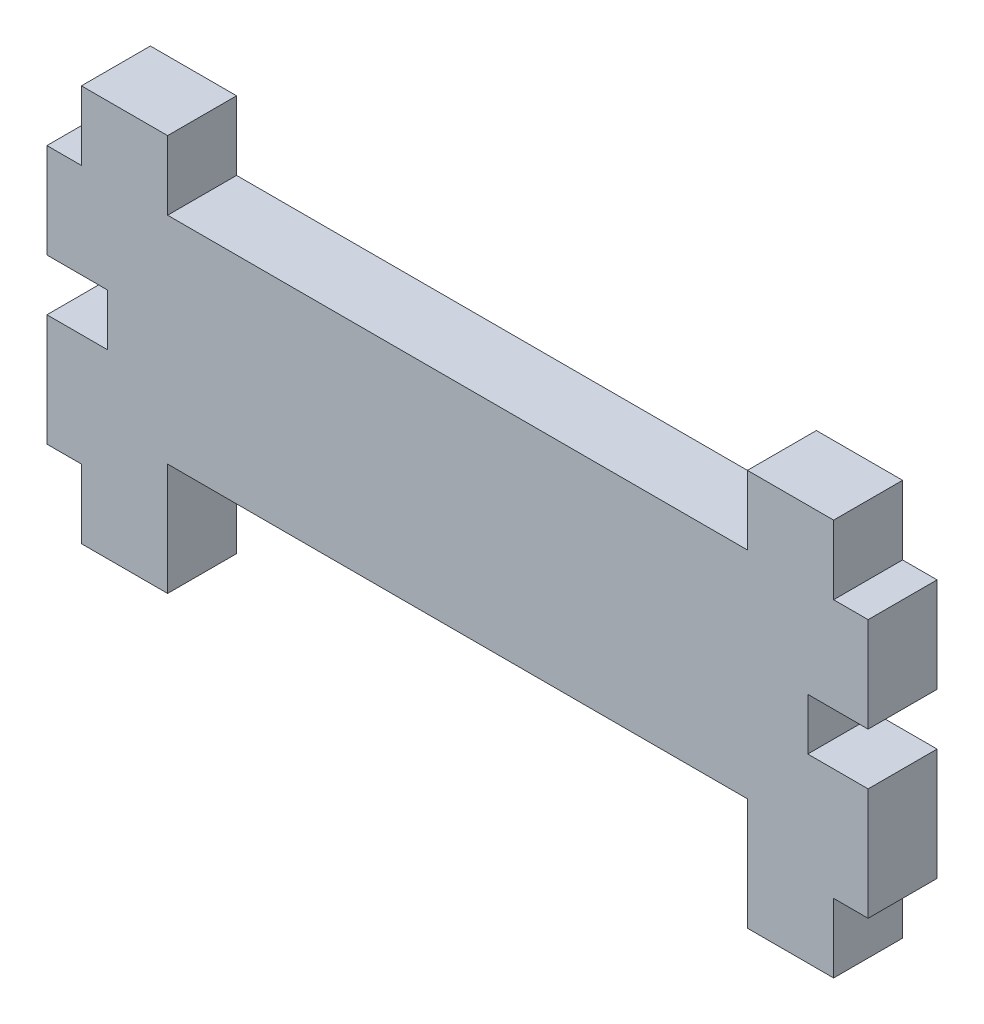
ISO-10303-21;
HEADER;
FILE_DESCRIPTION(('STEP AP214'),'2;1');
FILE_NAME('part.step','',(''),(''),'','','');
FILE_SCHEMA(('AUTOMOTIVE_DESIGN { 1 0 10303 214 1 1 1 1 }'));
ENDSEC;
DATA;
#1=APPLICATION_CONTEXT('core data for automotive mechanical design processes');
#2=APPLICATION_PROTOCOL_DEFINITION('international standard','automotive_design',2000,#1);
#3=PRODUCT_CONTEXT('',#1,'mechanical');
#4=PRODUCT('Part','Part','',(#3));
#5=PRODUCT_RELATED_PRODUCT_CATEGORY('part','',(#4));
#6=PRODUCT_DEFINITION_FORMATION('','',#4);
#7=PRODUCT_DEFINITION_CONTEXT('part definition',#1,'design');
#8=PRODUCT_DEFINITION('design','',#6,#7);
#9=PRODUCT_DEFINITION_SHAPE('','',#8);
#10=(LENGTH_UNIT() NAMED_UNIT(*) SI_UNIT(.MILLI.,.METRE.));
#11=(NAMED_UNIT(*) PLANE_ANGLE_UNIT() SI_UNIT($,.RADIAN.));
#12=(NAMED_UNIT(*) SI_UNIT($,.STERADIAN.) SOLID_ANGLE_UNIT());
#13=UNCERTAINTY_MEASURE_WITH_UNIT(LENGTH_MEASURE(1.E-05),#10,'distance_accuracy_value','');
#14=(GEOMETRIC_REPRESENTATION_CONTEXT(3) GLOBAL_UNCERTAINTY_ASSIGNED_CONTEXT((#13)) GLOBAL_UNIT_ASSIGNED_CONTEXT((#10,
#11,#12)) REPRESENTATION_CONTEXT('',''));
#15=CARTESIAN_POINT('',(0.,0.,0.));
#16=DIRECTION('',(0.,0.,1.));
#17=DIRECTION('',(1.,0.,0.));
#18=AXIS2_PLACEMENT_3D('',#15,#16,#17);
#19=CARTESIAN_POINT('',(35.0512616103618,-17.3140808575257,4.));
#20=DIRECTION('',(0.,1.,0.));
#21=DIRECTION('',(0.,0.,1.));
#22=AXIS2_PLACEMENT_3D('',#19,#20,#21);
#23=PLANE('',#22);
#24=DIRECTION('',(1.,0.,0.));
#25=VECTOR('',#24,1.);
#26=CARTESIAN_POINT('',(35.0512616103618,-17.3140808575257,0.));
#27=LINE('',#26,#25);
#28=CARTESIAN_POINT('',(33.0512616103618,-17.3140808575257,0.));
#29=VERTEX_POINT('',#28);
#30=CARTESIAN_POINT('',(35.0512616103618,-17.3140808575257,0.));
#31=VERTEX_POINT('',#30);
#32=EDGE_CURVE('E248',#29,#31,#27,.T.);
#33=ORIENTED_EDGE('',*,*,#32,.T.);
#34=DIRECTION('',(0.,0.,-1.));
#35=VECTOR('',#34,1.);
#36=CARTESIAN_POINT('',(35.0512616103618,-17.3140808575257,4.));
#37=LINE('',#36,#35);
#38=CARTESIAN_POINT('',(35.0512616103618,-17.3140808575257,4.));
#39=VERTEX_POINT('',#38);
#40=EDGE_CURVE('E11',#39,#31,#37,.T.);
#41=ORIENTED_EDGE('',*,*,#40,.F.);
#42=DIRECTION('',(1.,0.,0.));
#43=VECTOR('',#42,1.);
#44=CARTESIAN_POINT('',(35.0512616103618,-17.3140808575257,4.));
#45=LINE('',#44,#43);
#46=CARTESIAN_POINT('',(33.0512616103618,-17.3140808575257,4.));
#47=VERTEX_POINT('',#46);
#48=EDGE_CURVE('E304',#47,#39,#45,.T.);
#49=ORIENTED_EDGE('',*,*,#48,.F.);
#50=DIRECTION('',(0.,0.,-1.));
#51=VECTOR('',#50,1.);
#52=CARTESIAN_POINT('',(33.0512616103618,-17.3140808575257,4.));
#53=LINE('',#52,#51);
#54=EDGE_CURVE('E244',#47,#29,#53,.T.);
#55=ORIENTED_EDGE('',*,*,#54,.T.);
#56=EDGE_LOOP('',(#33,#41,#49,#55));
#57=FACE_BOUND('',#56,.T.);
#58=ADVANCED_FACE('F33',(#57),#23,.F.);
#59=CARTESIAN_POINT('',(35.0512616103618,-17.3140808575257,4.));
#60=DIRECTION('',(-1.,0.,0.));
#61=DIRECTION('',(0.,0.,1.));
#62=AXIS2_PLACEMENT_3D('',#59,#60,#61);
#63=PLANE('',#62);
#64=DIRECTION('',(0.,1.,0.));
#65=VECTOR('',#64,1.);
#66=CARTESIAN_POINT('',(35.0512616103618,-17.3140808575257,0.));
#67=LINE('',#66,#65);
#68=CARTESIAN_POINT('',(35.0512616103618,-10.8140808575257,0.));
#69=VERTEX_POINT('',#68);
#70=EDGE_CURVE('E251',#31,#69,#67,.T.);
#71=ORIENTED_EDGE('',*,*,#70,.T.);
#72=DIRECTION('',(0.,0.,-1.));
#73=VECTOR('',#72,1.);
#74=CARTESIAN_POINT('',(35.0512616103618,-10.8140808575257,4.));
#75=LINE('',#74,#73);
#76=CARTESIAN_POINT('',(35.0512616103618,-10.8140808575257,4.));
#77=VERTEX_POINT('',#76);
#78=EDGE_CURVE('E41',#77,#69,#75,.T.);
#79=ORIENTED_EDGE('',*,*,#78,.F.);
#80=DIRECTION('',(0.,1.,0.));
#81=VECTOR('',#80,1.);
#82=CARTESIAN_POINT('',(35.0512616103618,-17.3140808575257,4.));
#83=LINE('',#82,#81);
#84=EDGE_CURVE('E152',#39,#77,#83,.T.);
#85=ORIENTED_EDGE('',*,*,#84,.F.);
#86=ORIENTED_EDGE('',*,*,#40,.T.);
#87=EDGE_LOOP('',(#71,#79,#85,#86));
#88=FACE_BOUND('',#87,.T.);
#89=ADVANCED_FACE('F462',(#88),#63,.F.);
#90=CARTESIAN_POINT('',(35.0512616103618,-10.8140808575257,4.));
#91=DIRECTION('',(0.,-1.,0.));
#92=DIRECTION('',(0.,0.,-1.));
#93=AXIS2_PLACEMENT_3D('',#90,#91,#92);
#94=PLANE('',#93);
#95=DIRECTION('',(-1.,0.,0.));
#96=VECTOR('',#95,1.);
#97=CARTESIAN_POINT('',(35.0512616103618,-10.8140808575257,0.));
#98=LINE('',#97,#96);
#99=CARTESIAN_POINT('',(31.5512616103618,-10.8140808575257,0.));
#100=VERTEX_POINT('',#99);
#101=EDGE_CURVE('E253',#69,#100,#98,.T.);
#102=ORIENTED_EDGE('',*,*,#101,.T.);
#103=DIRECTION('',(0.,0.,-1.));
#104=VECTOR('',#103,1.);
#105=CARTESIAN_POINT('',(31.5512616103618,-10.8140808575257,4.));
#106=LINE('',#105,#104);
#107=CARTESIAN_POINT('',(31.5512616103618,-10.8140808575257,4.));
#108=VERTEX_POINT('',#107);
#109=EDGE_CURVE('E371',#108,#100,#106,.T.);
#110=ORIENTED_EDGE('',*,*,#109,.F.);
#111=DIRECTION('',(-1.,0.,0.));
#112=VECTOR('',#111,1.);
#113=CARTESIAN_POINT('',(35.0512616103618,-10.8140808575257,4.));
#114=LINE('',#113,#112);
#115=EDGE_CURVE('E379',#77,#108,#114,.T.);
#116=ORIENTED_EDGE('',*,*,#115,.F.);
#117=ORIENTED_EDGE('',*,*,#78,.T.);
#118=EDGE_LOOP('',(#102,#110,#116,#117));
#119=FACE_BOUND('',#118,.T.);
#120=ADVANCED_FACE('F377',(#119),#94,.F.);
#121=CARTESIAN_POINT('',(31.5512616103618,-10.8140808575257,4.));
#122=DIRECTION('',(-1.,0.,0.));
#123=DIRECTION('',(0.,0.,1.));
#124=AXIS2_PLACEMENT_3D('',#121,#122,#123);
#125=PLANE('',#124);
#126=DIRECTION('',(0.,1.,0.));
#127=VECTOR('',#126,1.);
#128=CARTESIAN_POINT('',(31.5512616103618,-10.8140808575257,0.));
#129=LINE('',#128,#127);
#130=CARTESIAN_POINT('',(31.5512616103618,-7.81408085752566,0.));
#131=VERTEX_POINT('',#130);
#132=EDGE_CURVE('E255',#100,#131,#129,.T.);
#133=ORIENTED_EDGE('',*,*,#132,.T.);
#134=DIRECTION('',(0.,0.,-1.));
#135=VECTOR('',#134,1.);
#136=CARTESIAN_POINT('',(31.5512616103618,-7.81408085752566,4.));
#137=LINE('',#136,#135);
#138=CARTESIAN_POINT('',(31.5512616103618,-7.81408085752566,4.));
#139=VERTEX_POINT('',#138);
#140=EDGE_CURVE('E368',#139,#131,#137,.T.);
#141=ORIENTED_EDGE('',*,*,#140,.F.);
#142=DIRECTION('',(0.,1.,0.));
#143=VECTOR('',#142,1.);
#144=CARTESIAN_POINT('',(31.5512616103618,-10.8140808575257,4.));
#145=LINE('',#144,#143);
#146=EDGE_CURVE('E397',#108,#139,#145,.T.);
#147=ORIENTED_EDGE('',*,*,#146,.F.);
#148=ORIENTED_EDGE('',*,*,#109,.T.);
#149=EDGE_LOOP('',(#133,#141,#147,#148));
#150=FACE_BOUND('',#149,.T.);
#151=ADVANCED_FACE('F388',(#150),#125,.F.);
#152=CARTESIAN_POINT('',(31.5512616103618,-7.81408085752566,4.));
#153=DIRECTION('',(0.,1.,0.));
#154=DIRECTION('',(0.,0.,1.));
#155=AXIS2_PLACEMENT_3D('',#152,#153,#154);
#156=PLANE('',#155);
#157=DIRECTION('',(1.,0.,0.));
#158=VECTOR('',#157,1.);
#159=CARTESIAN_POINT('',(31.5512616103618,-7.81408085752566,0.));
#160=LINE('',#159,#158);
#161=CARTESIAN_POINT('',(35.0512616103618,-7.81408085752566,0.));
#162=VERTEX_POINT('',#161);
#163=EDGE_CURVE('E257',#131,#162,#160,.T.);
#164=ORIENTED_EDGE('',*,*,#163,.T.);
#165=DIRECTION('',(0.,0.,-1.));
#166=VECTOR('',#165,1.);
#167=CARTESIAN_POINT('',(35.0512616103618,-7.81408085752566,4.));
#168=LINE('',#167,#166);
#169=CARTESIAN_POINT('',(35.0512616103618,-7.81408085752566,4.));
#170=VERTEX_POINT('',#169);
#171=EDGE_CURVE('E365',#170,#162,#168,.T.);
#172=ORIENTED_EDGE('',*,*,#171,.F.);
#173=DIRECTION('',(1.,0.,0.));
#174=VECTOR('',#173,1.);
#175=CARTESIAN_POINT('',(31.5512616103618,-7.81408085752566,4.));
#176=LINE('',#175,#174);
#177=EDGE_CURVE('E394',#139,#170,#176,.T.);
#178=ORIENTED_EDGE('',*,*,#177,.F.);
#179=ORIENTED_EDGE('',*,*,#140,.T.);
#180=EDGE_LOOP('',(#164,#172,#178,#179));
#181=FACE_BOUND('',#180,.T.);
#182=ADVANCED_FACE('F392',(#181),#156,.F.);
#183=CARTESIAN_POINT('',(35.0512616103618,-7.81408085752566,4.));
#184=DIRECTION('',(-1.,0.,0.));
#185=DIRECTION('',(0.,0.,1.));
#186=AXIS2_PLACEMENT_3D('',#183,#184,#185);
#187=PLANE('',#186);
#188=DIRECTION('',(0.,1.,0.));
#189=VECTOR('',#188,1.);
#190=CARTESIAN_POINT('',(35.0512616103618,-7.81408085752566,0.));
#191=LINE('',#190,#189);
#192=CARTESIAN_POINT('',(35.0512616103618,-2.31408085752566,0.));
#193=VERTEX_POINT('',#192);
#194=EDGE_CURVE('E259',#162,#193,#191,.T.);
#195=ORIENTED_EDGE('',*,*,#194,.T.);
#196=DIRECTION('',(0.,0.,-1.));
#197=VECTOR('',#196,1.);
#198=CARTESIAN_POINT('',(35.0512616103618,-2.31408085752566,4.));
#199=LINE('',#198,#197);
#200=CARTESIAN_POINT('',(35.0512616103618,-2.31408085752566,4.));
#201=VERTEX_POINT('',#200);
#202=EDGE_CURVE('E362',#201,#193,#199,.T.);
#203=ORIENTED_EDGE('',*,*,#202,.F.);
#204=DIRECTION('',(0.,1.,0.));
#205=VECTOR('',#204,1.);
#206=CARTESIAN_POINT('',(35.0512616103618,-7.81408085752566,4.));
#207=LINE('',#206,#205);
#208=EDGE_CURVE('E396',#170,#201,#207,.T.);
#209=ORIENTED_EDGE('',*,*,#208,.F.);
#210=ORIENTED_EDGE('',*,*,#171,.T.);
#211=EDGE_LOOP('',(#195,#203,#209,#210));
#212=FACE_BOUND('',#211,.T.);
#213=ADVANCED_FACE('F475',(#212),#187,.F.);
#214=CARTESIAN_POINT('',(33.0512616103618,-2.31408085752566,4.));
#215=DIRECTION('',(0.,-1.,0.));
#216=DIRECTION('',(0.,0.,-1.));
#217=AXIS2_PLACEMENT_3D('',#214,#215,#216);
#218=PLANE('',#217);
#219=DIRECTION('',(-1.,0.,0.));
#220=VECTOR('',#219,1.);
#221=CARTESIAN_POINT('',(33.0512616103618,-2.31408085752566,0.));
#222=LINE('',#221,#220);
#223=CARTESIAN_POINT('',(33.0512616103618,-2.31408085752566,0.));
#224=VERTEX_POINT('',#223);
#225=EDGE_CURVE('E261',#193,#224,#222,.T.);
#226=ORIENTED_EDGE('',*,*,#225,.T.);
#227=DIRECTION('',(0.,0.,-1.));
#228=VECTOR('',#227,1.);
#229=CARTESIAN_POINT('',(33.0512616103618,-2.31408085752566,4.));
#230=LINE('',#229,#228);
#231=CARTESIAN_POINT('',(33.0512616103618,-2.31408085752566,4.));
#232=VERTEX_POINT('',#231);
#233=EDGE_CURVE('E359',#232,#224,#230,.T.);
#234=ORIENTED_EDGE('',*,*,#233,.F.);
#235=DIRECTION('',(-1.,0.,0.));
#236=VECTOR('',#235,1.);
#237=CARTESIAN_POINT('',(33.0512616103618,-2.31408085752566,4.));
#238=LINE('',#237,#236);
#239=EDGE_CURVE('E399',#201,#232,#238,.T.);
#240=ORIENTED_EDGE('',*,*,#239,.F.);
#241=ORIENTED_EDGE('',*,*,#202,.T.);
#242=EDGE_LOOP('',(#226,#234,#240,#241));
#243=FACE_BOUND('',#242,.T.);
#244=ADVANCED_FACE('F478',(#243),#218,.F.);
#245=CARTESIAN_POINT('',(33.0512616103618,-2.31408085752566,4.));
#246=DIRECTION('',(-1.,0.,0.));
#247=DIRECTION('',(0.,0.,1.));
#248=AXIS2_PLACEMENT_3D('',#245,#246,#247);
#249=PLANE('',#248);
#250=DIRECTION('',(0.,1.,0.));
#251=VECTOR('',#250,1.);
#252=CARTESIAN_POINT('',(33.0512616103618,-2.31408085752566,0.));
#253=LINE('',#252,#251);
#254=CARTESIAN_POINT('',(33.0512616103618,1.68591914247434,0.));
#255=VERTEX_POINT('',#254);
#256=EDGE_CURVE('E263',#224,#255,#253,.T.);
#257=ORIENTED_EDGE('',*,*,#256,.T.);
#258=DIRECTION('',(0.,0.,-1.));
#259=VECTOR('',#258,1.);
#260=CARTESIAN_POINT('',(33.0512616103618,1.68591914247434,4.));
#261=LINE('',#260,#259);
#262=CARTESIAN_POINT('',(33.0512616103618,1.68591914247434,4.));
#263=VERTEX_POINT('',#262);
#264=EDGE_CURVE('E356',#263,#255,#261,.T.);
#265=ORIENTED_EDGE('',*,*,#264,.F.);
#266=DIRECTION('',(0.,1.,0.));
#267=VECTOR('',#266,1.);
#268=CARTESIAN_POINT('',(33.0512616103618,-2.31408085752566,4.));
#269=LINE('',#268,#267);
#270=EDGE_CURVE('E405',#232,#263,#269,.T.);
#271=ORIENTED_EDGE('',*,*,#270,.F.);
#272=ORIENTED_EDGE('',*,*,#233,.T.);
#273=EDGE_LOOP('',(#257,#265,#271,#272));
#274=FACE_BOUND('',#273,.T.);
#275=ADVANCED_FACE('F482',(#274),#249,.F.);
#276=CARTESIAN_POINT('',(33.0512616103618,1.68591914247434,4.));
#277=DIRECTION('',(0.,-1.,0.));
#278=DIRECTION('',(0.,0.,-1.));
#279=AXIS2_PLACEMENT_3D('',#276,#277,#278);
#280=PLANE('',#279);
#281=DIRECTION('',(-1.,0.,0.));
#282=VECTOR('',#281,1.);
#283=CARTESIAN_POINT('',(33.0512616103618,1.68591914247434,0.));
#284=LINE('',#283,#282);
#285=CARTESIAN_POINT('',(28.0512616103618,1.68591914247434,0.));
#286=VERTEX_POINT('',#285);
#287=EDGE_CURVE('E265',#255,#286,#284,.T.);
#288=ORIENTED_EDGE('',*,*,#287,.T.);
#289=DIRECTION('',(0.,0.,-1.));
#290=VECTOR('',#289,1.);
#291=CARTESIAN_POINT('',(28.0512616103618,1.68591914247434,4.));
#292=LINE('',#291,#290);
#293=CARTESIAN_POINT('',(28.0512616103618,1.68591914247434,4.));
#294=VERTEX_POINT('',#293);
#295=EDGE_CURVE('E353',#294,#286,#292,.T.);
#296=ORIENTED_EDGE('',*,*,#295,.F.);
#297=DIRECTION('',(-1.,0.,0.));
#298=VECTOR('',#297,1.);
#299=CARTESIAN_POINT('',(33.0512616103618,1.68591914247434,4.));
#300=LINE('',#299,#298);
#301=EDGE_CURVE('E407',#263,#294,#300,.T.);
#302=ORIENTED_EDGE('',*,*,#301,.F.);
#303=ORIENTED_EDGE('',*,*,#264,.T.);
#304=EDGE_LOOP('',(#288,#296,#302,#303));
#305=FACE_BOUND('',#304,.T.);
#306=ADVANCED_FACE('F486',(#305),#280,.F.);
#307=CARTESIAN_POINT('',(28.0512616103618,1.68591914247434,4.));
#308=DIRECTION('',(1.,0.,0.));
#309=DIRECTION('',(0.,0.,-1.));
#310=AXIS2_PLACEMENT_3D('',#307,#308,#309);
#311=PLANE('',#310);
#312=DIRECTION('',(0.,-1.,0.));
#313=VECTOR('',#312,1.);
#314=CARTESIAN_POINT('',(28.0512616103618,1.68591914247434,0.));
#315=LINE('',#314,#313);
#316=CARTESIAN_POINT('',(28.0512616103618,-2.31408085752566,0.));
#317=VERTEX_POINT('',#316);
#318=EDGE_CURVE('E267',#286,#317,#315,.T.);
#319=ORIENTED_EDGE('',*,*,#318,.T.);
#320=DIRECTION('',(0.,0.,-1.));
#321=VECTOR('',#320,1.);
#322=CARTESIAN_POINT('',(28.0512616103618,-2.31408085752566,4.));
#323=LINE('',#322,#321);
#324=CARTESIAN_POINT('',(28.0512616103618,-2.31408085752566,4.));
#325=VERTEX_POINT('',#324);
#326=EDGE_CURVE('E350',#325,#317,#323,.T.);
#327=ORIENTED_EDGE('',*,*,#326,.F.);
#328=DIRECTION('',(0.,-1.,0.));
#329=VECTOR('',#328,1.);
#330=CARTESIAN_POINT('',(28.0512616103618,1.68591914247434,4.));
#331=LINE('',#330,#329);
#332=EDGE_CURVE('E409',#294,#325,#331,.T.);
#333=ORIENTED_EDGE('',*,*,#332,.F.);
#334=ORIENTED_EDGE('',*,*,#295,.T.);
#335=EDGE_LOOP('',(#319,#327,#333,#334));
#336=FACE_BOUND('',#335,.T.);
#337=ADVANCED_FACE('F490',(#336),#311,.F.);
#338=CARTESIAN_POINT('',(28.0512616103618,-2.31408085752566,4.));
#339=DIRECTION('',(0.,-1.,0.));
#340=DIRECTION('',(0.,0.,-1.));
#341=AXIS2_PLACEMENT_3D('',#338,#339,#340);
#342=PLANE('',#341);
#343=DIRECTION('',(-1.,0.,0.));
#344=VECTOR('',#343,1.);
#345=CARTESIAN_POINT('',(28.0512616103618,-2.31408085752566,0.));
#346=LINE('',#345,#344);
#347=CARTESIAN_POINT('',(-5.57873838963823,-2.31408085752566,0.));
#348=VERTEX_POINT('',#347);
#349=EDGE_CURVE('E269',#317,#348,#346,.T.);
#350=ORIENTED_EDGE('',*,*,#349,.T.);
#351=DIRECTION('',(0.,0.,-1.));
#352=VECTOR('',#351,1.);
#353=CARTESIAN_POINT('',(-5.57873838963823,-2.31408085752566,4.));
#354=LINE('',#353,#352);
#355=CARTESIAN_POINT('',(-5.57873838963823,-2.31408085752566,4.));
#356=VERTEX_POINT('',#355);
#357=EDGE_CURVE('E347',#356,#348,#354,.T.);
#358=ORIENTED_EDGE('',*,*,#357,.F.);
#359=DIRECTION('',(-1.,0.,0.));
#360=VECTOR('',#359,1.);
#361=CARTESIAN_POINT('',(28.0512616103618,-2.31408085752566,4.));
#362=LINE('',#361,#360);
#363=EDGE_CURVE('E411',#325,#356,#362,.T.);
#364=ORIENTED_EDGE('',*,*,#363,.F.);
#365=ORIENTED_EDGE('',*,*,#326,.T.);
#366=EDGE_LOOP('',(#350,#358,#364,#365));
#367=FACE_BOUND('',#366,.T.);
#368=ADVANCED_FACE('F494',(#367),#342,.F.);
#369=CARTESIAN_POINT('',(-5.57873838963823,1.68591914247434,4.));
#370=DIRECTION('',(-1.,0.,0.));
#371=DIRECTION('',(0.,0.,1.));
#372=AXIS2_PLACEMENT_3D('',#369,#370,#371);
#373=PLANE('',#372);
#374=DIRECTION('',(0.,1.,0.));
#375=VECTOR('',#374,1.);
#376=CARTESIAN_POINT('',(-5.57873838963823,1.68591914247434,0.));
#377=LINE('',#376,#375);
#378=CARTESIAN_POINT('',(-5.57873838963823,1.68591914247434,0.));
#379=VERTEX_POINT('',#378);
#380=EDGE_CURVE('E271',#348,#379,#377,.T.);
#381=ORIENTED_EDGE('',*,*,#380,.T.);
#382=DIRECTION('',(0.,0.,-1.));
#383=VECTOR('',#382,1.);
#384=CARTESIAN_POINT('',(-5.57873838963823,1.68591914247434,4.));
#385=LINE('',#384,#383);
#386=CARTESIAN_POINT('',(-5.57873838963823,1.68591914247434,4.));
#387=VERTEX_POINT('',#386);
#388=EDGE_CURVE('E344',#387,#379,#385,.T.);
#389=ORIENTED_EDGE('',*,*,#388,.F.);
#390=DIRECTION('',(0.,1.,0.));
#391=VECTOR('',#390,1.);
#392=CARTESIAN_POINT('',(-5.57873838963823,1.68591914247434,4.));
#393=LINE('',#392,#391);
#394=EDGE_CURVE('E413',#356,#387,#393,.T.);
#395=ORIENTED_EDGE('',*,*,#394,.F.);
#396=ORIENTED_EDGE('',*,*,#357,.T.);
#397=EDGE_LOOP('',(#381,#389,#395,#396));
#398=FACE_BOUND('',#397,.T.);
#399=ADVANCED_FACE('F498',(#398),#373,.F.);
#400=CARTESIAN_POINT('',(-10.5787383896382,1.68591914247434,4.));
#401=DIRECTION('',(0.,-1.,0.));
#402=DIRECTION('',(0.,0.,-1.));
#403=AXIS2_PLACEMENT_3D('',#400,#401,#402);
#404=PLANE('',#403);
#405=DIRECTION('',(-1.,0.,0.));
#406=VECTOR('',#405,1.);
#407=CARTESIAN_POINT('',(-10.5787383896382,1.68591914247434,0.));
#408=LINE('',#407,#406);
#409=CARTESIAN_POINT('',(-10.5787383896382,1.68591914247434,0.));
#410=VERTEX_POINT('',#409);
#411=EDGE_CURVE('E273',#379,#410,#408,.T.);
#412=ORIENTED_EDGE('',*,*,#411,.T.);
#413=DIRECTION('',(0.,0.,-1.));
#414=VECTOR('',#413,1.);
#415=CARTESIAN_POINT('',(-10.5787383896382,1.68591914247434,4.));
#416=LINE('',#415,#414);
#417=CARTESIAN_POINT('',(-10.5787383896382,1.68591914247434,4.));
#418=VERTEX_POINT('',#417);
#419=EDGE_CURVE('E341',#418,#410,#416,.T.);
#420=ORIENTED_EDGE('',*,*,#419,.F.);
#421=DIRECTION('',(-1.,0.,0.));
#422=VECTOR('',#421,1.);
#423=CARTESIAN_POINT('',(-10.5787383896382,1.68591914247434,4.));
#424=LINE('',#423,#422);
#425=EDGE_CURVE('E415',#387,#418,#424,.T.);
#426=ORIENTED_EDGE('',*,*,#425,.F.);
#427=ORIENTED_EDGE('',*,*,#388,.T.);
#428=EDGE_LOOP('',(#412,#420,#426,#427));
#429=FACE_BOUND('',#428,.T.);
#430=ADVANCED_FACE('F502',(#429),#404,.F.);
#431=CARTESIAN_POINT('',(-10.5787383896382,-2.31408085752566,4.));
#432=DIRECTION('',(1.,0.,0.));
#433=DIRECTION('',(0.,0.,-1.));
#434=AXIS2_PLACEMENT_3D('',#431,#432,#433);
#435=PLANE('',#434);
#436=DIRECTION('',(0.,-1.,0.));
#437=VECTOR('',#436,1.);
#438=CARTESIAN_POINT('',(-10.5787383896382,-2.31408085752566,0.));
#439=LINE('',#438,#437);
#440=CARTESIAN_POINT('',(-10.5787383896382,-2.31408085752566,0.));
#441=VERTEX_POINT('',#440);
#442=EDGE_CURVE('E275',#410,#441,#439,.T.);
#443=ORIENTED_EDGE('',*,*,#442,.T.);
#444=DIRECTION('',(0.,0.,-1.));
#445=VECTOR('',#444,1.);
#446=CARTESIAN_POINT('',(-10.5787383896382,-2.31408085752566,4.));
#447=LINE('',#446,#445);
#448=CARTESIAN_POINT('',(-10.5787383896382,-2.31408085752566,4.));
#449=VERTEX_POINT('',#448);
#450=EDGE_CURVE('E338',#449,#441,#447,.T.);
#451=ORIENTED_EDGE('',*,*,#450,.F.);
#452=DIRECTION('',(0.,-1.,0.));
#453=VECTOR('',#452,1.);
#454=CARTESIAN_POINT('',(-10.5787383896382,-2.31408085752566,4.));
#455=LINE('',#454,#453);
#456=EDGE_CURVE('E417',#418,#449,#455,.T.);
#457=ORIENTED_EDGE('',*,*,#456,.F.);
#458=ORIENTED_EDGE('',*,*,#419,.T.);
#459=EDGE_LOOP('',(#443,#451,#457,#458));
#460=FACE_BOUND('',#459,.T.);
#461=ADVANCED_FACE('F506',(#460),#435,.F.);
#462=CARTESIAN_POINT('',(-10.5787383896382,-2.31408085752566,4.));
#463=DIRECTION('',(0.,-1.,0.));
#464=DIRECTION('',(1.,0.,0.));
#465=AXIS2_PLACEMENT_3D('',#462,#463,#464);
#466=PLANE('',#465);
#467=DIRECTION('',(-1.,0.,0.));
#468=VECTOR('',#467,1.);
#469=CARTESIAN_POINT('',(-10.5787383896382,-2.31408085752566,0.));
#470=LINE('',#469,#468);
#471=CARTESIAN_POINT('',(-12.5787383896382,-2.31408085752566,0.));
#472=VERTEX_POINT('',#471);
#473=EDGE_CURVE('E277',#441,#472,#470,.T.);
#474=ORIENTED_EDGE('',*,*,#473,.T.);
#475=DIRECTION('',(0.,0.,-1.));
#476=VECTOR('',#475,1.);
#477=CARTESIAN_POINT('',(-12.5787383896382,-2.31408085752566,4.));
#478=LINE('',#477,#476);
#479=CARTESIAN_POINT('',(-12.5787383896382,-2.31408085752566,4.));
#480=VERTEX_POINT('',#479);
#481=EDGE_CURVE('E335',#480,#472,#478,.T.);
#482=ORIENTED_EDGE('',*,*,#481,.F.);
#483=DIRECTION('',(-1.,0.,0.));
#484=VECTOR('',#483,1.);
#485=CARTESIAN_POINT('',(-10.5787383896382,-2.31408085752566,4.));
#486=LINE('',#485,#484);
#487=EDGE_CURVE('E419',#449,#480,#486,.T.);
#488=ORIENTED_EDGE('',*,*,#487,.F.);
#489=ORIENTED_EDGE('',*,*,#450,.T.);
#490=EDGE_LOOP('',(#474,#482,#488,#489));
#491=FACE_BOUND('',#490,.T.);
#492=ADVANCED_FACE('F510',(#491),#466,.F.);
#493=CARTESIAN_POINT('',(-12.5787383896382,-7.81408085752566,4.));
#494=DIRECTION('',(1.,0.,0.));
#495=DIRECTION('',(0.,0.,-1.));
#496=AXIS2_PLACEMENT_3D('',#493,#494,#495);
#497=PLANE('',#496);
#498=DIRECTION('',(0.,-1.,0.));
#499=VECTOR('',#498,1.);
#500=CARTESIAN_POINT('',(-12.5787383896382,-7.81408085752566,0.));
#501=LINE('',#500,#499);
#502=CARTESIAN_POINT('',(-12.5787383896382,-7.81408085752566,0.));
#503=VERTEX_POINT('',#502);
#504=EDGE_CURVE('E279',#472,#503,#501,.T.);
#505=ORIENTED_EDGE('',*,*,#504,.T.);
#506=DIRECTION('',(0.,0.,-1.));
#507=VECTOR('',#506,1.);
#508=CARTESIAN_POINT('',(-12.5787383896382,-7.81408085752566,4.));
#509=LINE('',#508,#507);
#510=CARTESIAN_POINT('',(-12.5787383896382,-7.81408085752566,4.));
#511=VERTEX_POINT('',#510);
#512=EDGE_CURVE('E332',#511,#503,#509,.T.);
#513=ORIENTED_EDGE('',*,*,#512,.F.);
#514=DIRECTION('',(0.,-1.,0.));
#515=VECTOR('',#514,1.);
#516=CARTESIAN_POINT('',(-12.5787383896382,-7.81408085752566,4.));
#517=LINE('',#516,#515);
#518=EDGE_CURVE('E421',#480,#511,#517,.T.);
#519=ORIENTED_EDGE('',*,*,#518,.F.);
#520=ORIENTED_EDGE('',*,*,#481,.T.);
#521=EDGE_LOOP('',(#505,#513,#519,#520));
#522=FACE_BOUND('',#521,.T.);
#523=ADVANCED_FACE('F514',(#522),#497,.F.);
#524=CARTESIAN_POINT('',(-9.07873838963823,-7.81408085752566,4.));
#525=DIRECTION('',(0.,1.,0.));
#526=DIRECTION('',(0.,0.,1.));
#527=AXIS2_PLACEMENT_3D('',#524,#525,#526);
#528=PLANE('',#527);
#529=DIRECTION('',(1.,0.,0.));
#530=VECTOR('',#529,1.);
#531=CARTESIAN_POINT('',(-9.07873838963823,-7.81408085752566,0.));
#532=LINE('',#531,#530);
#533=CARTESIAN_POINT('',(-9.07873838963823,-7.81408085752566,0.));
#534=VERTEX_POINT('',#533);
#535=EDGE_CURVE('E281',#503,#534,#532,.T.);
#536=ORIENTED_EDGE('',*,*,#535,.T.);
#537=DIRECTION('',(0.,0.,-1.));
#538=VECTOR('',#537,1.);
#539=CARTESIAN_POINT('',(-9.07873838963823,-7.81408085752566,4.));
#540=LINE('',#539,#538);
#541=CARTESIAN_POINT('',(-9.07873838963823,-7.81408085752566,4.));
#542=VERTEX_POINT('',#541);
#543=EDGE_CURVE('E329',#542,#534,#540,.T.);
#544=ORIENTED_EDGE('',*,*,#543,.F.);
#545=DIRECTION('',(1.,0.,0.));
#546=VECTOR('',#545,1.);
#547=CARTESIAN_POINT('',(-9.07873838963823,-7.81408085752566,4.));
#548=LINE('',#547,#546);
#549=EDGE_CURVE('E423',#511,#542,#548,.T.);
#550=ORIENTED_EDGE('',*,*,#549,.F.);
#551=ORIENTED_EDGE('',*,*,#512,.T.);
#552=EDGE_LOOP('',(#536,#544,#550,#551));
#553=FACE_BOUND('',#552,.T.);
#554=ADVANCED_FACE('F518',(#553),#528,.F.);
#555=CARTESIAN_POINT('',(-9.07873838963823,-10.8140808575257,4.));
#556=DIRECTION('',(1.,0.,0.));
#557=DIRECTION('',(0.,0.,-1.));
#558=AXIS2_PLACEMENT_3D('',#555,#556,#557);
#559=PLANE('',#558);
#560=DIRECTION('',(0.,-1.,0.));
#561=VECTOR('',#560,1.);
#562=CARTESIAN_POINT('',(-9.07873838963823,-10.8140808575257,0.));
#563=LINE('',#562,#561);
#564=CARTESIAN_POINT('',(-9.07873838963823,-10.8140808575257,0.));
#565=VERTEX_POINT('',#564);
#566=EDGE_CURVE('E283',#534,#565,#563,.T.);
#567=ORIENTED_EDGE('',*,*,#566,.T.);
#568=DIRECTION('',(0.,0.,-1.));
#569=VECTOR('',#568,1.);
#570=CARTESIAN_POINT('',(-9.07873838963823,-10.8140808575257,4.));
#571=LINE('',#570,#569);
#572=CARTESIAN_POINT('',(-9.07873838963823,-10.8140808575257,4.));
#573=VERTEX_POINT('',#572);
#574=EDGE_CURVE('E326',#573,#565,#571,.T.);
#575=ORIENTED_EDGE('',*,*,#574,.F.);
#576=DIRECTION('',(0.,-1.,0.));
#577=VECTOR('',#576,1.);
#578=CARTESIAN_POINT('',(-9.07873838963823,-10.8140808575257,4.));
#579=LINE('',#578,#577);
#580=EDGE_CURVE('E425',#542,#573,#579,.T.);
#581=ORIENTED_EDGE('',*,*,#580,.F.);
#582=ORIENTED_EDGE('',*,*,#543,.T.);
#583=EDGE_LOOP('',(#567,#575,#581,#582));
#584=FACE_BOUND('',#583,.T.);
#585=ADVANCED_FACE('F522',(#584),#559,.F.);
#586=CARTESIAN_POINT('',(-12.5787383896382,-10.8140808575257,4.));
#587=DIRECTION('',(0.,-1.,0.));
#588=DIRECTION('',(0.,0.,-1.));
#589=AXIS2_PLACEMENT_3D('',#586,#587,#588);
#590=PLANE('',#589);
#591=DIRECTION('',(-1.,0.,0.));
#592=VECTOR('',#591,1.);
#593=CARTESIAN_POINT('',(-12.5787383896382,-10.8140808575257,0.));
#594=LINE('',#593,#592);
#595=CARTESIAN_POINT('',(-12.5787383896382,-10.8140808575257,0.));
#596=VERTEX_POINT('',#595);
#597=EDGE_CURVE('E285',#565,#596,#594,.T.);
#598=ORIENTED_EDGE('',*,*,#597,.T.);
#599=DIRECTION('',(0.,0.,-1.));
#600=VECTOR('',#599,1.);
#601=CARTESIAN_POINT('',(-12.5787383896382,-10.8140808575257,4.));
#602=LINE('',#601,#600);
#603=CARTESIAN_POINT('',(-12.5787383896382,-10.8140808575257,4.));
#604=VERTEX_POINT('',#603);
#605=EDGE_CURVE('E323',#604,#596,#602,.T.);
#606=ORIENTED_EDGE('',*,*,#605,.F.);
#607=DIRECTION('',(-1.,0.,0.));
#608=VECTOR('',#607,1.);
#609=CARTESIAN_POINT('',(-12.5787383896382,-10.8140808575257,4.));
#610=LINE('',#609,#608);
#611=EDGE_CURVE('E427',#573,#604,#610,.T.);
#612=ORIENTED_EDGE('',*,*,#611,.F.);
#613=ORIENTED_EDGE('',*,*,#574,.T.);
#614=EDGE_LOOP('',(#598,#606,#612,#613));
#615=FACE_BOUND('',#614,.T.);
#616=ADVANCED_FACE('F526',(#615),#590,.F.);
#617=CARTESIAN_POINT('',(-12.5787383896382,-17.3140808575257,4.));
#618=DIRECTION('',(1.,0.,0.));
#619=DIRECTION('',(0.,1.,0.));
#620=AXIS2_PLACEMENT_3D('',#617,#618,#619);
#621=PLANE('',#620);
#622=DIRECTION('',(0.,-1.,0.));
#623=VECTOR('',#622,1.);
#624=CARTESIAN_POINT('',(-12.5787383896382,-17.3140808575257,0.));
#625=LINE('',#624,#623);
#626=CARTESIAN_POINT('',(-12.5787383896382,-17.3140808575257,0.));
#627=VERTEX_POINT('',#626);
#628=EDGE_CURVE('E287',#596,#627,#625,.T.);
#629=ORIENTED_EDGE('',*,*,#628,.T.);
#630=DIRECTION('',(0.,0.,-1.));
#631=VECTOR('',#630,1.);
#632=CARTESIAN_POINT('',(-12.5787383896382,-17.3140808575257,4.));
#633=LINE('',#632,#631);
#634=CARTESIAN_POINT('',(-12.5787383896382,-17.3140808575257,4.));
#635=VERTEX_POINT('',#634);
#636=EDGE_CURVE('E320',#635,#627,#633,.T.);
#637=ORIENTED_EDGE('',*,*,#636,.F.);
#638=DIRECTION('',(0.,-1.,0.));
#639=VECTOR('',#638,1.);
#640=CARTESIAN_POINT('',(-12.5787383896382,-17.3140808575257,4.));
#641=LINE('',#640,#639);
#642=EDGE_CURVE('E429',#604,#635,#641,.T.);
#643=ORIENTED_EDGE('',*,*,#642,.F.);
#644=ORIENTED_EDGE('',*,*,#605,.T.);
#645=EDGE_LOOP('',(#629,#637,#643,#644));
#646=FACE_BOUND('',#645,.T.);
#647=ADVANCED_FACE('F530',(#646),#621,.F.);
#648=CARTESIAN_POINT('',(-12.5787383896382,-17.3140808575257,4.));
#649=DIRECTION('',(0.,1.,0.));
#650=DIRECTION('',(0.,0.,1.));
#651=AXIS2_PLACEMENT_3D('',#648,#649,#650);
#652=PLANE('',#651);
#653=DIRECTION('',(1.,0.,0.));
#654=VECTOR('',#653,1.);
#655=CARTESIAN_POINT('',(-12.5787383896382,-17.3140808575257,0.));
#656=LINE('',#655,#654);
#657=CARTESIAN_POINT('',(-10.5787383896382,-17.3140808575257,0.));
#658=VERTEX_POINT('',#657);
#659=EDGE_CURVE('E289',#627,#658,#656,.T.);
#660=ORIENTED_EDGE('',*,*,#659,.T.);
#661=DIRECTION('',(0.,0.,-1.));
#662=VECTOR('',#661,1.);
#663=CARTESIAN_POINT('',(-10.5787383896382,-17.3140808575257,4.));
#664=LINE('',#663,#662);
#665=CARTESIAN_POINT('',(-10.5787383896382,-17.3140808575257,4.));
#666=VERTEX_POINT('',#665);
#667=EDGE_CURVE('E317',#666,#658,#664,.T.);
#668=ORIENTED_EDGE('',*,*,#667,.F.);
#669=DIRECTION('',(1.,0.,0.));
#670=VECTOR('',#669,1.);
#671=CARTESIAN_POINT('',(-12.5787383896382,-17.3140808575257,4.));
#672=LINE('',#671,#670);
#673=EDGE_CURVE('E431',#635,#666,#672,.T.);
#674=ORIENTED_EDGE('',*,*,#673,.F.);
#675=ORIENTED_EDGE('',*,*,#636,.T.);
#676=EDGE_LOOP('',(#660,#668,#674,#675));
#677=FACE_BOUND('',#676,.T.);
#678=ADVANCED_FACE('F534',(#677),#652,.F.);
#679=CARTESIAN_POINT('',(-10.5787383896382,-17.3140808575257,4.));
#680=DIRECTION('',(1.,0.,0.));
#681=DIRECTION('',(0.,0.,-1.));
#682=AXIS2_PLACEMENT_3D('',#679,#680,#681);
#683=PLANE('',#682);
#684=DIRECTION('',(0.,-1.,0.));
#685=VECTOR('',#684,1.);
#686=CARTESIAN_POINT('',(-10.5787383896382,-17.3140808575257,0.));
#687=LINE('',#686,#685);
#688=CARTESIAN_POINT('',(-10.5787383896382,-21.3140808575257,0.));
#689=VERTEX_POINT('',#688);
#690=EDGE_CURVE('E291',#658,#689,#687,.T.);
#691=ORIENTED_EDGE('',*,*,#690,.T.);
#692=DIRECTION('',(0.,0.,-1.));
#693=VECTOR('',#692,1.);
#694=CARTESIAN_POINT('',(-10.5787383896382,-21.3140808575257,4.));
#695=LINE('',#694,#693);
#696=CARTESIAN_POINT('',(-10.5787383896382,-21.3140808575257,4.));
#697=VERTEX_POINT('',#696);
#698=EDGE_CURVE('E314',#697,#689,#695,.T.);
#699=ORIENTED_EDGE('',*,*,#698,.F.);
#700=DIRECTION('',(0.,-1.,0.));
#701=VECTOR('',#700,1.);
#702=CARTESIAN_POINT('',(-10.5787383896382,-17.3140808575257,4.));
#703=LINE('',#702,#701);
#704=EDGE_CURVE('E433',#666,#697,#703,.T.);
#705=ORIENTED_EDGE('',*,*,#704,.F.);
#706=ORIENTED_EDGE('',*,*,#667,.T.);
#707=EDGE_LOOP('',(#691,#699,#705,#706));
#708=FACE_BOUND('',#707,.T.);
#709=ADVANCED_FACE('F538',(#708),#683,.F.);
#710=CARTESIAN_POINT('',(-10.5787383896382,-21.3140808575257,4.));
#711=DIRECTION('',(0.,1.,0.));
#712=DIRECTION('',(0.,0.,1.));
#713=AXIS2_PLACEMENT_3D('',#710,#711,#712);
#714=PLANE('',#713);
#715=DIRECTION('',(1.,0.,0.));
#716=VECTOR('',#715,1.);
#717=CARTESIAN_POINT('',(-10.5787383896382,-21.3140808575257,0.));
#718=LINE('',#717,#716);
#719=CARTESIAN_POINT('',(-5.57873838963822,-21.3140808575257,0.));
#720=VERTEX_POINT('',#719);
#721=EDGE_CURVE('E293',#689,#720,#718,.T.);
#722=ORIENTED_EDGE('',*,*,#721,.T.);
#723=DIRECTION('',(0.,0.,-1.));
#724=VECTOR('',#723,1.);
#725=CARTESIAN_POINT('',(-5.57873838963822,-21.3140808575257,4.));
#726=LINE('',#725,#724);
#727=CARTESIAN_POINT('',(-5.57873838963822,-21.3140808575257,4.));
#728=VERTEX_POINT('',#727);
#729=EDGE_CURVE('E311',#728,#720,#726,.T.);
#730=ORIENTED_EDGE('',*,*,#729,.F.);
#731=DIRECTION('',(1.,0.,0.));
#732=VECTOR('',#731,1.);
#733=CARTESIAN_POINT('',(-10.5787383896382,-21.3140808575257,4.));
#734=LINE('',#733,#732);
#735=EDGE_CURVE('E435',#697,#728,#734,.T.);
#736=ORIENTED_EDGE('',*,*,#735,.F.);
#737=ORIENTED_EDGE('',*,*,#698,.T.);
#738=EDGE_LOOP('',(#722,#730,#736,#737));
#739=FACE_BOUND('',#738,.T.);
#740=ADVANCED_FACE('F542',(#739),#714,.F.);
#741=CARTESIAN_POINT('',(-5.57873838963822,-17.3140808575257,4.));
#742=DIRECTION('',(-1.,0.,0.));
#743=DIRECTION('',(0.,0.,1.));
#744=AXIS2_PLACEMENT_3D('',#741,#742,#743);
#745=PLANE('',#744);
#746=DIRECTION('',(0.,1.,0.));
#747=VECTOR('',#746,1.);
#748=CARTESIAN_POINT('',(-5.57873838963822,-17.3140808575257,0.));
#749=LINE('',#748,#747);
#750=CARTESIAN_POINT('',(-5.57873838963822,-14.8140808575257,0.));
#751=VERTEX_POINT('',#750);
#752=EDGE_CURVE('E296',#720,#751,#749,.T.);
#753=ORIENTED_EDGE('',*,*,#752,.T.);
#754=DIRECTION('',(0.,0.,-1.));
#755=VECTOR('',#754,1.);
#756=CARTESIAN_POINT('',(-5.57873838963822,-14.8140808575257,4.));
#757=LINE('',#756,#755);
#758=CARTESIAN_POINT('',(-5.57873838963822,-14.8140808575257,4.));
#759=VERTEX_POINT('',#758);
#760=EDGE_CURVE('E308',#759,#751,#757,.T.);
#761=ORIENTED_EDGE('',*,*,#760,.F.);
#762=DIRECTION('',(0.,1.,0.));
#763=VECTOR('',#762,1.);
#764=CARTESIAN_POINT('',(-5.57873838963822,-21.3140808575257,4.));
#765=LINE('',#764,#763);
#766=EDGE_CURVE('E437',#728,#759,#765,.T.);
#767=ORIENTED_EDGE('',*,*,#766,.F.);
#768=ORIENTED_EDGE('',*,*,#729,.T.);
#769=EDGE_LOOP('',(#753,#761,#767,#768));
#770=FACE_BOUND('',#769,.T.);
#771=ADVANCED_FACE('F443',(#770),#745,.F.);
#772=CARTESIAN_POINT('',(28.0512616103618,-14.8140808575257,4.));
#773=DIRECTION('',(0.,1.,0.));
#774=DIRECTION('',(0.,0.,1.));
#775=AXIS2_PLACEMENT_3D('',#772,#773,#774);
#776=PLANE('',#775);
#777=DIRECTION('',(1.,0.,0.));
#778=VECTOR('',#777,1.);
#779=CARTESIAN_POINT('',(28.0512616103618,-14.8140808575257,0.));
#780=LINE('',#779,#778);
#781=CARTESIAN_POINT('',(28.0512616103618,-14.8140808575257,0.));
#782=VERTEX_POINT('',#781);
#783=EDGE_CURVE('E298',#751,#782,#780,.T.);
#784=ORIENTED_EDGE('',*,*,#783,.T.);
#785=DIRECTION('',(0.,0.,-1.));
#786=VECTOR('',#785,1.);
#787=CARTESIAN_POINT('',(28.0512616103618,-14.8140808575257,4.));
#788=LINE('',#787,#786);
#789=CARTESIAN_POINT('',(28.0512616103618,-14.8140808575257,4.));
#790=VERTEX_POINT('',#789);
#791=EDGE_CURVE('E239',#790,#782,#788,.T.);
#792=ORIENTED_EDGE('',*,*,#791,.F.);
#793=DIRECTION('',(1.,0.,0.));
#794=VECTOR('',#793,1.);
#795=CARTESIAN_POINT('',(28.0512616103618,-14.8140808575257,4.));
#796=LINE('',#795,#794);
#797=EDGE_CURVE('E231',#759,#790,#796,.T.);
#798=ORIENTED_EDGE('',*,*,#797,.F.);
#799=ORIENTED_EDGE('',*,*,#760,.T.);
#800=EDGE_LOOP('',(#784,#792,#798,#799));
#801=FACE_BOUND('',#800,.T.);
#802=ADVANCED_FACE('F446',(#801),#776,.F.);
#803=CARTESIAN_POINT('',(28.0512616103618,-21.3140808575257,4.));
#804=DIRECTION('',(1.,0.,0.));
#805=DIRECTION('',(0.,0.,-1.));
#806=AXIS2_PLACEMENT_3D('',#803,#804,#805);
#807=PLANE('',#806);
#808=DIRECTION('',(0.,-1.,0.));
#809=VECTOR('',#808,1.);
#810=CARTESIAN_POINT('',(28.0512616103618,-21.3140808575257,0.));
#811=LINE('',#810,#809);
#812=CARTESIAN_POINT('',(28.0512616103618,-21.3140808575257,0.));
#813=VERTEX_POINT('',#812);
#814=EDGE_CURVE('E238',#782,#813,#811,.T.);
#815=ORIENTED_EDGE('',*,*,#814,.T.);
#816=DIRECTION('',(0.,0.,-1.));
#817=VECTOR('',#816,1.);
#818=CARTESIAN_POINT('',(28.0512616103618,-21.3140808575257,4.));
#819=LINE('',#818,#817);
#820=CARTESIAN_POINT('',(28.0512616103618,-21.3140808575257,4.));
#821=VERTEX_POINT('',#820);
#822=EDGE_CURVE('E236',#821,#813,#819,.T.);
#823=ORIENTED_EDGE('',*,*,#822,.F.);
#824=DIRECTION('',(0.,-1.,0.));
#825=VECTOR('',#824,1.);
#826=CARTESIAN_POINT('',(28.0512616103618,-17.3140808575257,4.));
#827=LINE('',#826,#825);
#828=EDGE_CURVE('E225',#790,#821,#827,.T.);
#829=ORIENTED_EDGE('',*,*,#828,.F.);
#830=ORIENTED_EDGE('',*,*,#791,.T.);
#831=EDGE_LOOP('',(#815,#823,#829,#830));
#832=FACE_BOUND('',#831,.T.);
#833=ADVANCED_FACE('F237',(#832),#807,.F.);
#834=CARTESIAN_POINT('',(33.0512616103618,-21.3140808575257,4.));
#835=DIRECTION('',(0.,1.,0.));
#836=DIRECTION('',(0.,0.,1.));
#837=AXIS2_PLACEMENT_3D('',#834,#835,#836);
#838=PLANE('',#837);
#839=DIRECTION('',(1.,0.,0.));
#840=VECTOR('',#839,1.);
#841=CARTESIAN_POINT('',(33.0512616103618,-21.3140808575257,0.));
#842=LINE('',#841,#840);
#843=CARTESIAN_POINT('',(33.0512616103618,-21.3140808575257,0.));
#844=VERTEX_POINT('',#843);
#845=EDGE_CURVE('E138',#813,#844,#842,.T.);
#846=ORIENTED_EDGE('',*,*,#845,.T.);
#847=DIRECTION('',(0.,0.,-1.));
#848=VECTOR('',#847,1.);
#849=CARTESIAN_POINT('',(33.0512616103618,-21.3140808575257,4.));
#850=LINE('',#849,#848);
#851=CARTESIAN_POINT('',(33.0512616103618,-21.3140808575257,4.));
#852=VERTEX_POINT('',#851);
#853=EDGE_CURVE('E240',#852,#844,#850,.T.);
#854=ORIENTED_EDGE('',*,*,#853,.F.);
#855=DIRECTION('',(1.,0.,0.));
#856=VECTOR('',#855,1.);
#857=CARTESIAN_POINT('',(33.0512616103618,-21.3140808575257,4.));
#858=LINE('',#857,#856);
#859=EDGE_CURVE('E229',#821,#852,#858,.T.);
#860=ORIENTED_EDGE('',*,*,#859,.F.);
#861=ORIENTED_EDGE('',*,*,#822,.T.);
#862=EDGE_LOOP('',(#846,#854,#860,#861));
#863=FACE_BOUND('',#862,.T.);
#864=ADVANCED_FACE('F242',(#863),#838,.F.);
#865=CARTESIAN_POINT('',(33.0512616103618,-17.3140808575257,4.));
#866=DIRECTION('',(-1.,0.,0.));
#867=DIRECTION('',(0.,0.,1.));
#868=AXIS2_PLACEMENT_3D('',#865,#866,#867);
#869=PLANE('',#868);
#870=DIRECTION('',(0.,1.,0.));
#871=VECTOR('',#870,1.);
#872=CARTESIAN_POINT('',(33.0512616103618,-17.3140808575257,0.));
#873=LINE('',#872,#871);
#874=EDGE_CURVE('E144',#844,#29,#873,.T.);
#875=ORIENTED_EDGE('',*,*,#874,.T.);
#876=ORIENTED_EDGE('',*,*,#54,.F.);
#877=DIRECTION('',(0.,1.,0.));
#878=VECTOR('',#877,1.);
#879=CARTESIAN_POINT('',(33.0512616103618,-17.3140808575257,4.));
#880=LINE('',#879,#878);
#881=EDGE_CURVE('E49',#852,#47,#880,.T.);
#882=ORIENTED_EDGE('',*,*,#881,.F.);
#883=ORIENTED_EDGE('',*,*,#853,.T.);
#884=EDGE_LOOP('',(#875,#876,#882,#883));
#885=FACE_BOUND('',#884,.T.);
#886=ADVANCED_FACE('F451',(#885),#869,.F.);
#887=CARTESIAN_POINT('',(0.,0.,4.));
#888=DIRECTION('',(0.,0.,1.));
#889=DIRECTION('',(1.,0.,0.));
#890=AXIS2_PLACEMENT_3D('',#887,#888,#889);
#891=PLANE('',#890);
#892=ORIENTED_EDGE('',*,*,#48,.T.);
#893=ORIENTED_EDGE('',*,*,#84,.T.);
#894=ORIENTED_EDGE('',*,*,#115,.T.);
#895=ORIENTED_EDGE('',*,*,#146,.T.);
#896=ORIENTED_EDGE('',*,*,#177,.T.);
#897=ORIENTED_EDGE('',*,*,#208,.T.);
#898=ORIENTED_EDGE('',*,*,#239,.T.);
#899=ORIENTED_EDGE('',*,*,#270,.T.);
#900=ORIENTED_EDGE('',*,*,#301,.T.);
#901=ORIENTED_EDGE('',*,*,#332,.T.);
#902=ORIENTED_EDGE('',*,*,#363,.T.);
#903=ORIENTED_EDGE('',*,*,#394,.T.);
#904=ORIENTED_EDGE('',*,*,#425,.T.);
#905=ORIENTED_EDGE('',*,*,#456,.T.);
#906=ORIENTED_EDGE('',*,*,#487,.T.);
#907=ORIENTED_EDGE('',*,*,#518,.T.);
#908=ORIENTED_EDGE('',*,*,#549,.T.);
#909=ORIENTED_EDGE('',*,*,#580,.T.);
#910=ORIENTED_EDGE('',*,*,#611,.T.);
#911=ORIENTED_EDGE('',*,*,#642,.T.);
#912=ORIENTED_EDGE('',*,*,#673,.T.);
#913=ORIENTED_EDGE('',*,*,#704,.T.);
#914=ORIENTED_EDGE('',*,*,#735,.T.);
#915=ORIENTED_EDGE('',*,*,#766,.T.);
#916=ORIENTED_EDGE('',*,*,#797,.T.);
#917=ORIENTED_EDGE('',*,*,#828,.T.);
#918=ORIENTED_EDGE('',*,*,#859,.T.);
#919=ORIENTED_EDGE('',*,*,#881,.T.);
#920=EDGE_LOOP('',(#892,#893,#894,#895,#896,#897,#898,#899,#900,#901,#902,#903,#904,#905,#906,
#907,#908,#909,#910,#911,#912,#913,#914,#915,#916,#917,#918,#919));
#921=FACE_BOUND('',#920,.T.);
#922=ADVANCED_FACE('F227',(#921),#891,.T.);
#923=CARTESIAN_POINT('',(0.,0.,0.));
#924=DIRECTION('',(0.,0.,1.));
#925=DIRECTION('',(1.,0.,0.));
#926=AXIS2_PLACEMENT_3D('',#923,#924,#925);
#927=PLANE('',#926);
#928=ORIENTED_EDGE('',*,*,#32,.F.);
#929=ORIENTED_EDGE('',*,*,#874,.F.);
#930=ORIENTED_EDGE('',*,*,#845,.F.);
#931=ORIENTED_EDGE('',*,*,#814,.F.);
#932=ORIENTED_EDGE('',*,*,#783,.F.);
#933=ORIENTED_EDGE('',*,*,#752,.F.);
#934=ORIENTED_EDGE('',*,*,#721,.F.);
#935=ORIENTED_EDGE('',*,*,#690,.F.);
#936=ORIENTED_EDGE('',*,*,#659,.F.);
#937=ORIENTED_EDGE('',*,*,#628,.F.);
#938=ORIENTED_EDGE('',*,*,#597,.F.);
#939=ORIENTED_EDGE('',*,*,#566,.F.);
#940=ORIENTED_EDGE('',*,*,#535,.F.);
#941=ORIENTED_EDGE('',*,*,#504,.F.);
#942=ORIENTED_EDGE('',*,*,#473,.F.);
#943=ORIENTED_EDGE('',*,*,#442,.F.);
#944=ORIENTED_EDGE('',*,*,#411,.F.);
#945=ORIENTED_EDGE('',*,*,#380,.F.);
#946=ORIENTED_EDGE('',*,*,#349,.F.);
#947=ORIENTED_EDGE('',*,*,#318,.F.);
#948=ORIENTED_EDGE('',*,*,#287,.F.);
#949=ORIENTED_EDGE('',*,*,#256,.F.);
#950=ORIENTED_EDGE('',*,*,#225,.F.);
#951=ORIENTED_EDGE('',*,*,#194,.F.);
#952=ORIENTED_EDGE('',*,*,#163,.F.);
#953=ORIENTED_EDGE('',*,*,#132,.F.);
#954=ORIENTED_EDGE('',*,*,#101,.F.);
#955=ORIENTED_EDGE('',*,*,#70,.F.);
#956=EDGE_LOOP('',(#928,#929,#930,#931,#932,#933,#934,#935,#936,#937,#938,#939,#940,#941,#942,
#943,#944,#945,#946,#947,#948,#949,#950,#951,#952,#953,#954,#955));
#957=FACE_BOUND('',#956,.T.);
#958=ADVANCED_FACE('F383',(#957),#927,.F.);
#959=CLOSED_SHELL('',(#58,#89,#120,#151,#182,#213,#244,#275,#306,#337,#368,#399,#430,#461,#492,
#523,#554,#585,#616,#647,#678,#709,#740,#771,#802,#833,#864,#886,#922,#958));
#960=MANIFOLD_SOLID_BREP('B2',#959);
#961=ADVANCED_BREP_SHAPE_REPRESENTATION('',(#18,#960),#14);
#962=SHAPE_DEFINITION_REPRESENTATION(#9,#961);
ENDSEC;
END-ISO-10303-21;
